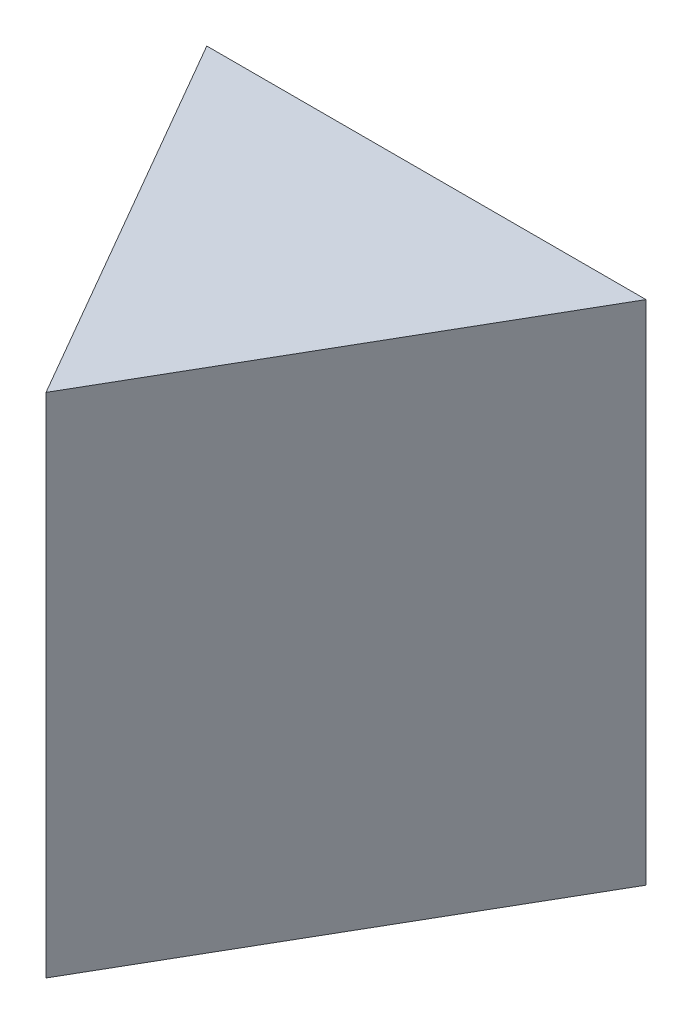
ISO-10303-21;
HEADER;
FILE_DESCRIPTION(('STEP AP214'),'2;1');
FILE_NAME('part.step','',(''),(''),'','','');
FILE_SCHEMA(('AUTOMOTIVE_DESIGN { 1 0 10303 214 1 1 1 1 }'));
ENDSEC;
DATA;
#1=APPLICATION_CONTEXT('core data for automotive mechanical design processes');
#2=APPLICATION_PROTOCOL_DEFINITION('international standard','automotive_design',2000,#1);
#3=PRODUCT_CONTEXT('',#1,'mechanical');
#4=PRODUCT('Part','Part','',(#3));
#5=PRODUCT_RELATED_PRODUCT_CATEGORY('part','',(#4));
#6=PRODUCT_DEFINITION_FORMATION('','',#4);
#7=PRODUCT_DEFINITION_CONTEXT('part definition',#1,'design');
#8=PRODUCT_DEFINITION('design','',#6,#7);
#9=PRODUCT_DEFINITION_SHAPE('','',#8);
#10=(LENGTH_UNIT() NAMED_UNIT(*) SI_UNIT(.MILLI.,.METRE.));
#11=(NAMED_UNIT(*) PLANE_ANGLE_UNIT() SI_UNIT($,.RADIAN.));
#12=(NAMED_UNIT(*) SI_UNIT($,.STERADIAN.) SOLID_ANGLE_UNIT());
#13=UNCERTAINTY_MEASURE_WITH_UNIT(LENGTH_MEASURE(1.E-05),#10,'distance_accuracy_value','');
#14=(GEOMETRIC_REPRESENTATION_CONTEXT(3) GLOBAL_UNCERTAINTY_ASSIGNED_CONTEXT((#13)) GLOBAL_UNIT_ASSIGNED_CONTEXT((#10,
#11,#12)) REPRESENTATION_CONTEXT('',''));
#15=CARTESIAN_POINT('',(0.,0.,0.));
#16=DIRECTION('',(0.,0.,1.));
#17=DIRECTION('',(1.,0.,0.));
#18=AXIS2_PLACEMENT_3D('',#15,#16,#17);
#19=CARTESIAN_POINT('',(0.,10.,0.));
#20=DIRECTION('',(0.,1.,0.));
#21=DIRECTION('',(0.,0.,1.));
#22=AXIS2_PLACEMENT_3D('',#19,#20,#21);
#23=PLANE('',#22);
#24=DIRECTION('',(-1.,0.,0.));
#25=VECTOR('',#24,1.);
#26=CARTESIAN_POINT('',(0.,10.,-2.5));
#27=LINE('',#26,#25);
#28=CARTESIAN_POINT('',(4.33012701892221,10.,-2.49999999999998));
#29=VERTEX_POINT('',#28);
#30=CARTESIAN_POINT('',(-4.33012701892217,10.,-2.50000000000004));
#31=VERTEX_POINT('',#30);
#32=EDGE_CURVE('E37',#29,#31,#27,.T.);
#33=ORIENTED_EDGE('',*,*,#32,.T.);
#34=DIRECTION('',(0.499999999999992,0.,0.866025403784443));
#35=VECTOR('',#34,1.);
#36=CARTESIAN_POINT('',(-2.16506350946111,10.,1.24999999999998));
#37=LINE('',#36,#35);
#38=CARTESIAN_POINT('',(0.,10.,5.));
#39=VERTEX_POINT('',#38);
#40=EDGE_CURVE('E66',#31,#39,#37,.T.);
#41=ORIENTED_EDGE('',*,*,#40,.T.);
#42=DIRECTION('',(0.500000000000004,0.,-0.866025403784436));
#43=VECTOR('',#42,1.);
#44=CARTESIAN_POINT('',(2.16506350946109,10.,1.25000000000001));
#45=LINE('',#44,#43);
#46=EDGE_CURVE('E70',#39,#29,#45,.T.);
#47=ORIENTED_EDGE('',*,*,#46,.T.);
#48=EDGE_LOOP('',(#33,#41,#47));
#49=FACE_BOUND('',#48,.T.);
#50=ADVANCED_FACE('F30',(#49),#23,.T.);
#51=CARTESIAN_POINT('',(0.,0.,0.));
#52=DIRECTION('',(0.,1.,0.));
#53=DIRECTION('',(0.,0.,1.));
#54=AXIS2_PLACEMENT_3D('',#51,#52,#53);
#55=PLANE('',#54);
#56=DIRECTION('',(0.499999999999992,0.,0.866025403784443));
#57=VECTOR('',#56,1.);
#58=CARTESIAN_POINT('',(-2.16506350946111,0.,1.24999999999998));
#59=LINE('',#58,#57);
#60=CARTESIAN_POINT('',(-4.33012701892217,0.,-2.50000000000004));
#61=VERTEX_POINT('',#60);
#62=CARTESIAN_POINT('',(0.,0.,5.));
#63=VERTEX_POINT('',#62);
#64=EDGE_CURVE('E69',#61,#63,#59,.T.);
#65=ORIENTED_EDGE('',*,*,#64,.F.);
#66=DIRECTION('',(-1.,0.,0.));
#67=VECTOR('',#66,1.);
#68=CARTESIAN_POINT('',(0.,0.,-2.5));
#69=LINE('',#68,#67);
#70=CARTESIAN_POINT('',(4.33012701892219,0.,-2.5));
#71=VERTEX_POINT('',#70);
#72=EDGE_CURVE('E11',#71,#61,#69,.T.);
#73=ORIENTED_EDGE('',*,*,#72,.F.);
#74=DIRECTION('',(0.500000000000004,0.,-0.866025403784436));
#75=VECTOR('',#74,1.);
#76=CARTESIAN_POINT('',(2.16506350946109,0.,1.25000000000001));
#77=LINE('',#76,#75);
#78=EDGE_CURVE('E44',#63,#71,#77,.T.);
#79=ORIENTED_EDGE('',*,*,#78,.F.);
#80=EDGE_LOOP('',(#65,#73,#79));
#81=FACE_BOUND('',#80,.T.);
#82=ADVANCED_FACE('F85',(#81),#55,.F.);
#83=CARTESIAN_POINT('',(-4.33012701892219,34.150635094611,-2.5));
#84=DIRECTION('',(0.,0.,-1.));
#85=DIRECTION('',(-1.,0.,0.));
#86=AXIS2_PLACEMENT_3D('',#83,#84,#85);
#87=PLANE('',#86);
#88=ORIENTED_EDGE('',*,*,#32,.F.);
#89=DIRECTION('',(0.,-1.,0.));
#90=VECTOR('',#89,1.);
#91=CARTESIAN_POINT('',(4.33012701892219,34.150635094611,-2.5));
#92=LINE('',#91,#90);
#93=EDGE_CURVE('E49',#29,#71,#92,.T.);
#94=ORIENTED_EDGE('',*,*,#93,.T.);
#95=ORIENTED_EDGE('',*,*,#72,.T.);
#96=DIRECTION('',(0.,-1.,0.));
#97=VECTOR('',#96,1.);
#98=CARTESIAN_POINT('',(-4.33012701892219,34.150635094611,-2.5));
#99=LINE('',#98,#97);
#100=EDGE_CURVE('E81',#31,#61,#99,.T.);
#101=ORIENTED_EDGE('',*,*,#100,.F.);
#102=EDGE_LOOP('',(#88,#94,#95,#101));
#103=FACE_BOUND('',#102,.T.);
#104=ADVANCED_FACE('F86',(#103),#87,.T.);
#105=CARTESIAN_POINT('',(4.33012701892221,34.150635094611,-2.49999999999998));
#106=DIRECTION('',(0.866025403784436,0.,0.500000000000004));
#107=DIRECTION('',(0.500000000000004,0.,-0.866025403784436));
#108=AXIS2_PLACEMENT_3D('',#105,#106,#107);
#109=PLANE('',#108);
#110=ORIENTED_EDGE('',*,*,#46,.F.);
#111=DIRECTION('',(0.,-1.,0.));
#112=VECTOR('',#111,1.);
#113=CARTESIAN_POINT('',(0.,34.150635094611,5.));
#114=LINE('',#113,#112);
#115=EDGE_CURVE('E63',#39,#63,#114,.T.);
#116=ORIENTED_EDGE('',*,*,#115,.T.);
#117=ORIENTED_EDGE('',*,*,#78,.T.);
#118=ORIENTED_EDGE('',*,*,#93,.F.);
#119=EDGE_LOOP('',(#110,#116,#117,#118));
#120=FACE_BOUND('',#119,.T.);
#121=ADVANCED_FACE('F76',(#120),#109,.T.);
#122=CARTESIAN_POINT('',(0.,34.150635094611,5.));
#123=DIRECTION('',(-0.866025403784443,0.,0.499999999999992));
#124=DIRECTION('',(0.499999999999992,0.,0.866025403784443));
#125=AXIS2_PLACEMENT_3D('',#122,#123,#124);
#126=PLANE('',#125);
#127=ORIENTED_EDGE('',*,*,#40,.F.);
#128=ORIENTED_EDGE('',*,*,#100,.T.);
#129=ORIENTED_EDGE('',*,*,#64,.T.);
#130=ORIENTED_EDGE('',*,*,#115,.F.);
#131=EDGE_LOOP('',(#127,#128,#129,#130));
#132=FACE_BOUND('',#131,.T.);
#133=ADVANCED_FACE('F65',(#132),#126,.T.);
#134=CLOSED_SHELL('',(#50,#82,#104,#121,#133));
#135=MANIFOLD_SOLID_BREP('B2',#134);
#136=ADVANCED_BREP_SHAPE_REPRESENTATION('',(#18,#135),#14);
#137=SHAPE_DEFINITION_REPRESENTATION(#9,#136);
ENDSEC;
END-ISO-10303-21;
